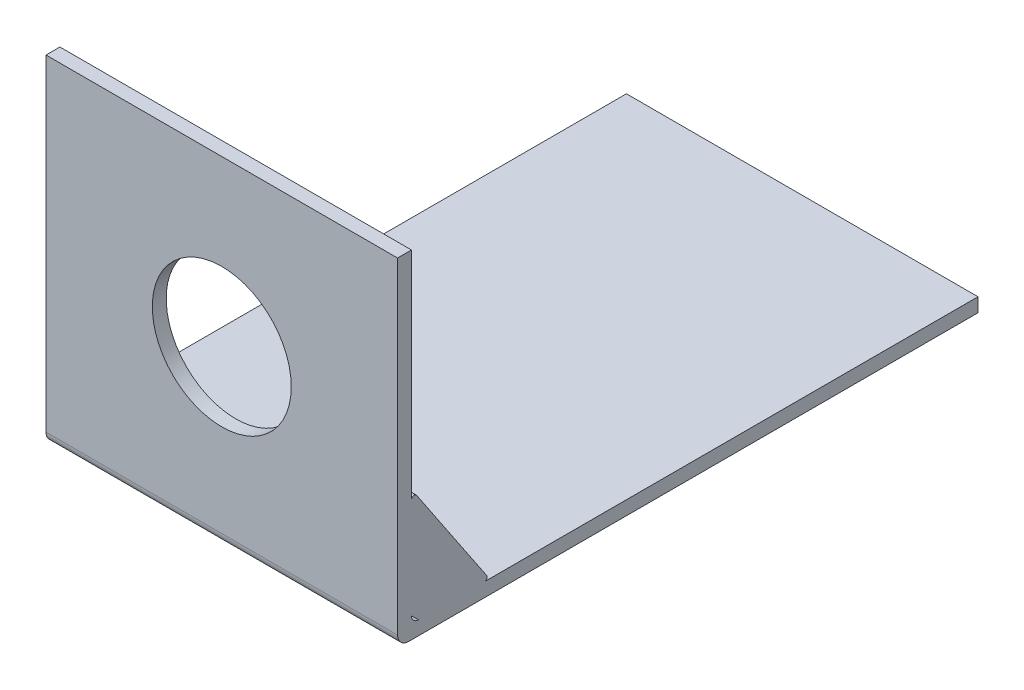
ISO-10303-21;
HEADER;
FILE_DESCRIPTION(('STEP AP214'),'2;1');
FILE_NAME('part.step','',(''),(''),'','','');
FILE_SCHEMA(('AUTOMOTIVE_DESIGN { 1 0 10303 214 1 1 1 1 }'));
ENDSEC;
DATA;
#1=APPLICATION_CONTEXT('core data for automotive mechanical design processes');
#2=APPLICATION_PROTOCOL_DEFINITION('international standard','automotive_design',2000,#1);
#3=PRODUCT_CONTEXT('',#1,'mechanical');
#4=PRODUCT('Part','Part','',(#3));
#5=PRODUCT_RELATED_PRODUCT_CATEGORY('part','',(#4));
#6=PRODUCT_DEFINITION_FORMATION('','',#4);
#7=PRODUCT_DEFINITION_CONTEXT('part definition',#1,'design');
#8=PRODUCT_DEFINITION('design','',#6,#7);
#9=PRODUCT_DEFINITION_SHAPE('','',#8);
#10=(LENGTH_UNIT() NAMED_UNIT(*) SI_UNIT(.MILLI.,.METRE.));
#11=(NAMED_UNIT(*) PLANE_ANGLE_UNIT() SI_UNIT($,.RADIAN.));
#12=(NAMED_UNIT(*) SI_UNIT($,.STERADIAN.) SOLID_ANGLE_UNIT());
#13=UNCERTAINTY_MEASURE_WITH_UNIT(LENGTH_MEASURE(1.E-05),#10,'distance_accuracy_value','');
#14=(GEOMETRIC_REPRESENTATION_CONTEXT(3) GLOBAL_UNCERTAINTY_ASSIGNED_CONTEXT((#13)) GLOBAL_UNIT_ASSIGNED_CONTEXT((#10,
#11,#12)) REPRESENTATION_CONTEXT('',''));
#15=CARTESIAN_POINT('',(0.,0.,0.));
#16=DIRECTION('',(0.,0.,1.));
#17=DIRECTION('',(1.,0.,0.));
#18=AXIS2_PLACEMENT_3D('',#15,#16,#17);
#19=CARTESIAN_POINT('',(-64.262,-59.182,-106.0958));
#20=DIRECTION('',(0.,1.,0.));
#21=DIRECTION('',(0.,0.,1.));
#22=AXIS2_PLACEMENT_3D('',#19,#20,#21);
#23=PLANE('',#22);
#24=DIRECTION('',(0.,0.,1.));
#25=VECTOR('',#24,1.);
#26=CARTESIAN_POINT('',(-64.262,-59.182,-106.0958));
#27=LINE('',#26,#25);
#28=CARTESIAN_POINT('',(-64.262,-59.182,-106.0958));
#29=VERTEX_POINT('',#28);
#30=CARTESIAN_POINT('',(-64.262,-59.182,-15.8724496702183));
#31=VERTEX_POINT('',#30);
#32=EDGE_CURVE('E310',#29,#31,#27,.T.);
#33=ORIENTED_EDGE('',*,*,#32,.T.);
#34=DIRECTION('',(-1.,0.,0.));
#35=VECTOR('',#34,1.);
#36=CARTESIAN_POINT('',(-61.722,-59.182,-15.8724496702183));
#37=LINE('',#36,#35);
#38=CARTESIAN_POINT('',(-61.722,-59.182,-15.8724496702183));
#39=VERTEX_POINT('',#38);
#40=EDGE_CURVE('E61',#39,#31,#37,.T.);
#41=ORIENTED_EDGE('',*,*,#40,.F.);
#42=DIRECTION('',(0.,0.,-1.));
#43=VECTOR('',#42,1.);
#44=CARTESIAN_POINT('',(-61.722,-59.182,-3.81000000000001));
#45=LINE('',#44,#43);
#46=CARTESIAN_POINT('',(-61.722,-59.182,-3.81000000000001));
#47=VERTEX_POINT('',#46);
#48=EDGE_CURVE('E207',#47,#39,#45,.T.);
#49=ORIENTED_EDGE('',*,*,#48,.F.);
#50=DIRECTION('',(1.,0.,0.));
#51=VECTOR('',#50,1.);
#52=CARTESIAN_POINT('',(-64.262,-59.182,-3.81000000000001));
#53=LINE('',#52,#51);
#54=CARTESIAN_POINT('',(-2.54,-59.182,-3.81000000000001));
#55=VERTEX_POINT('',#54);
#56=EDGE_CURVE('E356',#47,#55,#53,.T.);
#57=ORIENTED_EDGE('',*,*,#56,.T.);
#58=DIRECTION('',(0.,0.,-1.));
#59=VECTOR('',#58,1.);
#60=CARTESIAN_POINT('',(-2.54,-59.182,-3.81000000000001));
#61=LINE('',#60,#59);
#62=CARTESIAN_POINT('',(-2.54,-59.182,-15.8724496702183));
#63=VERTEX_POINT('',#62);
#64=EDGE_CURVE('E234',#55,#63,#61,.T.);
#65=ORIENTED_EDGE('',*,*,#64,.T.);
#66=DIRECTION('',(1.,0.,0.));
#67=VECTOR('',#66,1.);
#68=CARTESIAN_POINT('',(-2.54,-59.182,-15.8724496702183));
#69=LINE('',#68,#67);
#70=CARTESIAN_POINT('',(0.,-59.182,-15.8724496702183));
#71=VERTEX_POINT('',#70);
#72=EDGE_CURVE('E282',#63,#71,#69,.T.);
#73=ORIENTED_EDGE('',*,*,#72,.T.);
#74=DIRECTION('',(0.,0.,1.));
#75=VECTOR('',#74,1.);
#76=CARTESIAN_POINT('',(0.,-59.182,-106.0958));
#77=LINE('',#76,#75);
#78=CARTESIAN_POINT('',(0.,-59.182,-106.0958));
#79=VERTEX_POINT('',#78);
#80=EDGE_CURVE('E338',#79,#71,#77,.T.);
#81=ORIENTED_EDGE('',*,*,#80,.F.);
#82=DIRECTION('',(1.,0.,0.));
#83=VECTOR('',#82,1.);
#84=CARTESIAN_POINT('',(-64.262,-59.182,-106.0958));
#85=LINE('',#84,#83);
#86=EDGE_CURVE('E357',#29,#79,#85,.T.);
#87=ORIENTED_EDGE('',*,*,#86,.F.);
#88=EDGE_LOOP('',(#33,#41,#49,#57,#65,#73,#81,#87));
#89=FACE_BOUND('',#88,.T.);
#90=ADVANCED_FACE('F43',(#89),#23,.T.);
#91=CARTESIAN_POINT('',(-64.262,0.,0.));
#92=DIRECTION('',(0.,1.,0.));
#93=DIRECTION('',(0.,0.,1.));
#94=AXIS2_PLACEMENT_3D('',#91,#92,#93);
#95=PLANE('',#94);
#96=DIRECTION('',(0.,0.,1.));
#97=VECTOR('',#96,1.);
#98=CARTESIAN_POINT('',(0.,0.,0.));
#99=LINE('',#98,#97);
#100=CARTESIAN_POINT('',(0.,0.,-2.54));
#101=VERTEX_POINT('',#100);
#102=CARTESIAN_POINT('',(0.,0.,0.));
#103=VERTEX_POINT('',#102);
#104=EDGE_CURVE('E271',#101,#103,#99,.T.);
#105=ORIENTED_EDGE('',*,*,#104,.F.);
#106=DIRECTION('',(1.,0.,0.));
#107=VECTOR('',#106,1.);
#108=CARTESIAN_POINT('',(-64.262,0.,-2.54));
#109=LINE('',#108,#107);
#110=CARTESIAN_POINT('',(-64.262,0.,-2.54));
#111=VERTEX_POINT('',#110);
#112=EDGE_CURVE('E11',#111,#101,#109,.T.);
#113=ORIENTED_EDGE('',*,*,#112,.F.);
#114=DIRECTION('',(0.,0.,1.));
#115=VECTOR('',#114,1.);
#116=CARTESIAN_POINT('',(-64.262,0.,0.));
#117=LINE('',#116,#115);
#118=CARTESIAN_POINT('',(-64.262,0.,0.));
#119=VERTEX_POINT('',#118);
#120=EDGE_CURVE('E289',#111,#119,#117,.T.);
#121=ORIENTED_EDGE('',*,*,#120,.T.);
#122=DIRECTION('',(1.,0.,0.));
#123=VECTOR('',#122,1.);
#124=CARTESIAN_POINT('',(-64.262,0.,0.));
#125=LINE('',#124,#123);
#126=EDGE_CURVE('E47',#119,#103,#125,.T.);
#127=ORIENTED_EDGE('',*,*,#126,.T.);
#128=EDGE_LOOP('',(#105,#113,#121,#127));
#129=FACE_BOUND('',#128,.T.);
#130=ADVANCED_FACE('F45',(#129),#95,.T.);
#131=CARTESIAN_POINT('',(-64.262,0.,-2.54));
#132=DIRECTION('',(0.,0.,-1.));
#133=DIRECTION('',(0.,1.,0.));
#134=AXIS2_PLACEMENT_3D('',#131,#132,#133);
#135=PLANE('',#134);
#136=CARTESIAN_POINT('',(-32.131,-30.099,-2.54));
#137=DIRECTION('',(0.,0.,-1.));
#138=DIRECTION('',(0.,1.,0.));
#139=AXIS2_PLACEMENT_3D('',#136,#137,#138);
#140=CIRCLE('',#139,12.7);
#141=CARTESIAN_POINT('',(-32.131,-17.399,-2.54));
#142=VERTEX_POINT('',#141);
#143=EDGE_CURVE('E454',#142,#142,#140,.F.);
#144=ORIENTED_EDGE('',*,*,#143,.T.);
#145=EDGE_LOOP('',(#144));
#146=FACE_BOUND('',#145,.T.);
#147=DIRECTION('',(-1.,0.,0.));
#148=VECTOR('',#147,1.);
#149=CARTESIAN_POINT('',(-61.722,-39.5547256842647,-2.54));
#150=LINE('',#149,#148);
#151=CARTESIAN_POINT('',(-61.722,-39.5547256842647,-2.54));
#152=VERTEX_POINT('',#151);
#153=CARTESIAN_POINT('',(-64.262,-39.5547256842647,-2.54));
#154=VERTEX_POINT('',#153);
#155=EDGE_CURVE('E195',#152,#154,#150,.T.);
#156=ORIENTED_EDGE('',*,*,#155,.T.);
#157=DIRECTION('',(0.,1.,0.));
#158=VECTOR('',#157,1.);
#159=CARTESIAN_POINT('',(-64.262,0.,-2.54));
#160=LINE('',#159,#158);
#161=EDGE_CURVE('E316',#154,#111,#160,.T.);
#162=ORIENTED_EDGE('',*,*,#161,.T.);
#163=ORIENTED_EDGE('',*,*,#112,.T.);
#164=DIRECTION('',(0.,1.,0.));
#165=VECTOR('',#164,1.);
#166=CARTESIAN_POINT('',(0.,0.,-2.54));
#167=LINE('',#166,#165);
#168=CARTESIAN_POINT('',(0.,-39.5547256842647,-2.54000000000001));
#169=VERTEX_POINT('',#168);
#170=EDGE_CURVE('E294',#169,#101,#167,.T.);
#171=ORIENTED_EDGE('',*,*,#170,.F.);
#172=DIRECTION('',(1.,0.,0.));
#173=VECTOR('',#172,1.);
#174=CARTESIAN_POINT('',(-2.54,-39.5547256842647,-2.54));
#175=LINE('',#174,#173);
#176=CARTESIAN_POINT('',(-2.54,-39.5547256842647,-2.54));
#177=VERTEX_POINT('',#176);
#178=EDGE_CURVE('E272',#177,#169,#175,.T.);
#179=ORIENTED_EDGE('',*,*,#178,.F.);
#180=DIRECTION('',(0.,-1.,0.));
#181=VECTOR('',#180,1.);
#182=CARTESIAN_POINT('',(-2.54,-57.912,-2.54000000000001));
#183=LINE('',#182,#181);
#184=CARTESIAN_POINT('',(-2.54,-57.912,-2.54000000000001));
#185=VERTEX_POINT('',#184);
#186=EDGE_CURVE('E250',#177,#185,#183,.T.);
#187=ORIENTED_EDGE('',*,*,#186,.T.);
#188=DIRECTION('',(1.,0.,0.));
#189=VECTOR('',#188,1.);
#190=CARTESIAN_POINT('',(-64.262,-57.912,-2.54000000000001));
#191=LINE('',#190,#189);
#192=CARTESIAN_POINT('',(-61.722,-57.912,-2.54000000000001));
#193=VERTEX_POINT('',#192);
#194=EDGE_CURVE('E351',#193,#185,#191,.T.);
#195=ORIENTED_EDGE('',*,*,#194,.F.);
#196=DIRECTION('',(0.,-1.,0.));
#197=VECTOR('',#196,1.);
#198=CARTESIAN_POINT('',(-61.722,-57.912,-2.54000000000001));
#199=LINE('',#198,#197);
#200=EDGE_CURVE('E69',#152,#193,#199,.T.);
#201=ORIENTED_EDGE('',*,*,#200,.F.);
#202=EDGE_LOOP('',(#156,#162,#163,#171,#179,#187,#195,#201));
#203=FACE_BOUND('',#202,.T.);
#204=ADVANCED_FACE('F383',(#146,#203),#135,.T.);
#205=CARTESIAN_POINT('',(-64.262,-57.912,-3.81000000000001));
#206=DIRECTION('',(1.,0.,0.));
#207=DIRECTION('',(0.,0.,-1.));
#208=AXIS2_PLACEMENT_3D('',#205,#206,#207);
#209=CYLINDRICAL_SURFACE('',#208,1.27);
#210=CARTESIAN_POINT('',(0.,-57.912,-3.81000000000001));
#211=DIRECTION('',(-1.,0.,0.));
#212=DIRECTION('',(0.,0.,1.));
#213=AXIS2_PLACEMENT_3D('',#210,#211,#212);
#214=CIRCLE('',#213,1.27);
#215=CARTESIAN_POINT('',(0.,-59.182,-3.81000000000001));
#216=VERTEX_POINT('',#215);
#217=CARTESIAN_POINT('',(0.,-57.912,-2.54000000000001));
#218=VERTEX_POINT('',#217);
#219=EDGE_CURVE('E342',#216,#218,#214,.T.);
#220=ORIENTED_EDGE('',*,*,#219,.F.);
#221=DIRECTION('',(1.,0.,0.));
#222=VECTOR('',#221,1.);
#223=CARTESIAN_POINT('',(-2.54,-59.182,-3.81000000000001));
#224=LINE('',#223,#222);
#225=EDGE_CURVE('E254',#55,#216,#224,.T.);
#226=ORIENTED_EDGE('',*,*,#225,.F.);
#227=ORIENTED_EDGE('',*,*,#56,.F.);
#228=CARTESIAN_POINT('',(-64.262,-59.182,-3.81000000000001));
#229=VERTEX_POINT('',#228);
#230=EDGE_CURVE('E352',#229,#47,#53,.T.);
#231=ORIENTED_EDGE('',*,*,#230,.F.);
#232=CARTESIAN_POINT('',(-64.262,-57.912,-3.81000000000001));
#233=DIRECTION('',(-1.,0.,0.));
#234=DIRECTION('',(0.,0.,1.));
#235=AXIS2_PLACEMENT_3D('',#232,#233,#234);
#236=CIRCLE('',#235,1.27);
#237=CARTESIAN_POINT('',(-64.262,-57.912,-2.54000000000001));
#238=VERTEX_POINT('',#237);
#239=EDGE_CURVE('E313',#229,#238,#236,.T.);
#240=ORIENTED_EDGE('',*,*,#239,.T.);
#241=EDGE_CURVE('E53',#238,#193,#191,.T.);
#242=ORIENTED_EDGE('',*,*,#241,.T.);
#243=ORIENTED_EDGE('',*,*,#194,.T.);
#244=DIRECTION('',(1.,0.,0.));
#245=VECTOR('',#244,1.);
#246=CARTESIAN_POINT('',(-2.54,-57.912,-2.54000000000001));
#247=LINE('',#246,#245);
#248=EDGE_CURVE('E267',#185,#218,#247,.T.);
#249=ORIENTED_EDGE('',*,*,#248,.T.);
#250=EDGE_LOOP('',(#220,#226,#227,#231,#240,#242,#243,#249));
#251=FACE_BOUND('',#250,.T.);
#252=ADVANCED_FACE('F423',(#251),#209,.F.);
#253=CARTESIAN_POINT('',(-64.262,-61.722,-106.0958));
#254=DIRECTION('',(0.,0.,-1.));
#255=DIRECTION('',(0.,1.,0.));
#256=AXIS2_PLACEMENT_3D('',#253,#254,#255);
#257=PLANE('',#256);
#258=DIRECTION('',(0.,1.,0.));
#259=VECTOR('',#258,1.);
#260=CARTESIAN_POINT('',(0.,-61.722,-106.0958));
#261=LINE('',#260,#259);
#262=CARTESIAN_POINT('',(0.,-61.722,-106.0958));
#263=VERTEX_POINT('',#262);
#264=EDGE_CURVE('E334',#263,#79,#261,.T.);
#265=ORIENTED_EDGE('',*,*,#264,.F.);
#266=DIRECTION('',(1.,0.,0.));
#267=VECTOR('',#266,1.);
#268=CARTESIAN_POINT('',(-64.262,-61.722,-106.0958));
#269=LINE('',#268,#267);
#270=CARTESIAN_POINT('',(-64.262,-61.722,-106.0958));
#271=VERTEX_POINT('',#270);
#272=EDGE_CURVE('E360',#271,#263,#269,.T.);
#273=ORIENTED_EDGE('',*,*,#272,.F.);
#274=DIRECTION('',(0.,1.,0.));
#275=VECTOR('',#274,1.);
#276=CARTESIAN_POINT('',(-64.262,-61.722,-106.0958));
#277=LINE('',#276,#275);
#278=EDGE_CURVE('E306',#271,#29,#277,.T.);
#279=ORIENTED_EDGE('',*,*,#278,.T.);
#280=ORIENTED_EDGE('',*,*,#86,.T.);
#281=EDGE_LOOP('',(#265,#273,#279,#280));
#282=FACE_BOUND('',#281,.T.);
#283=ADVANCED_FACE('F398',(#282),#257,.T.);
#284=CARTESIAN_POINT('',(-64.262,-61.722,-2.032));
#285=DIRECTION('',(0.,-1.,0.));
#286=DIRECTION('',(0.,0.,-1.));
#287=AXIS2_PLACEMENT_3D('',#284,#285,#286);
#288=PLANE('',#287);
#289=DIRECTION('',(0.,0.,-1.));
#290=VECTOR('',#289,1.);
#291=CARTESIAN_POINT('',(0.,-61.722,-2.032));
#292=LINE('',#291,#290);
#293=CARTESIAN_POINT('',(0.,-61.722,-2.032));
#294=VERTEX_POINT('',#293);
#295=EDGE_CURVE('E330',#294,#263,#292,.T.);
#296=ORIENTED_EDGE('',*,*,#295,.F.);
#297=DIRECTION('',(1.,0.,0.));
#298=VECTOR('',#297,1.);
#299=CARTESIAN_POINT('',(-64.262,-61.722,-2.032));
#300=LINE('',#299,#298);
#301=CARTESIAN_POINT('',(-64.262,-61.722,-2.032));
#302=VERTEX_POINT('',#301);
#303=EDGE_CURVE('E363',#302,#294,#300,.T.);
#304=ORIENTED_EDGE('',*,*,#303,.F.);
#305=DIRECTION('',(0.,0.,-1.));
#306=VECTOR('',#305,1.);
#307=CARTESIAN_POINT('',(-64.262,-61.722,-2.032));
#308=LINE('',#307,#306);
#309=EDGE_CURVE('E302',#302,#271,#308,.T.);
#310=ORIENTED_EDGE('',*,*,#309,.T.);
#311=ORIENTED_EDGE('',*,*,#272,.T.);
#312=EDGE_LOOP('',(#296,#304,#310,#311));
#313=FACE_BOUND('',#312,.T.);
#314=ADVANCED_FACE('F396',(#313),#288,.T.);
#315=CARTESIAN_POINT('',(-64.262,-59.69,-2.032));
#316=DIRECTION('',(1.,0.,0.));
#317=DIRECTION('',(0.,0.,-1.));
#318=AXIS2_PLACEMENT_3D('',#315,#316,#317);
#319=CYLINDRICAL_SURFACE('',#318,2.032);
#320=CARTESIAN_POINT('',(0.,-59.69,-2.032));
#321=DIRECTION('',(1.,0.,0.));
#322=DIRECTION('',(0.,0.,1.));
#323=AXIS2_PLACEMENT_3D('',#320,#321,#322);
#324=CIRCLE('',#323,2.032);
#325=CARTESIAN_POINT('',(0.,-59.69,0.));
#326=VERTEX_POINT('',#325);
#327=EDGE_CURVE('E326',#326,#294,#324,.T.);
#328=ORIENTED_EDGE('',*,*,#327,.F.);
#329=DIRECTION('',(1.,0.,0.));
#330=VECTOR('',#329,1.);
#331=CARTESIAN_POINT('',(-64.262,-59.69,0.));
#332=LINE('',#331,#330);
#333=CARTESIAN_POINT('',(-64.262,-59.69,0.));
#334=VERTEX_POINT('',#333);
#335=EDGE_CURVE('E365',#334,#326,#332,.T.);
#336=ORIENTED_EDGE('',*,*,#335,.F.);
#337=CARTESIAN_POINT('',(-64.262,-59.69,-2.032));
#338=DIRECTION('',(1.,0.,0.));
#339=DIRECTION('',(0.,0.,1.));
#340=AXIS2_PLACEMENT_3D('',#337,#338,#339);
#341=CIRCLE('',#340,2.032);
#342=EDGE_CURVE('E298',#334,#302,#341,.T.);
#343=ORIENTED_EDGE('',*,*,#342,.T.);
#344=ORIENTED_EDGE('',*,*,#303,.T.);
#345=EDGE_LOOP('',(#328,#336,#343,#344));
#346=FACE_BOUND('',#345,.T.);
#347=ADVANCED_FACE('F392',(#346),#319,.T.);
#348=CARTESIAN_POINT('',(-64.262,-59.69,0.));
#349=DIRECTION('',(0.,0.,1.));
#350=DIRECTION('',(1.,0.,0.));
#351=AXIS2_PLACEMENT_3D('',#348,#349,#350);
#352=PLANE('',#351);
#353=CARTESIAN_POINT('',(-32.131,-30.099,0.));
#354=DIRECTION('',(0.,0.,1.));
#355=DIRECTION('',(1.,0.,0.));
#356=AXIS2_PLACEMENT_3D('',#353,#354,#355);
#357=CIRCLE('',#356,12.7);
#358=CARTESIAN_POINT('',(-19.431,-30.099,0.));
#359=VERTEX_POINT('',#358);
#360=EDGE_CURVE('E215',#359,#359,#357,.T.);
#361=ORIENTED_EDGE('',*,*,#360,.F.);
#362=EDGE_LOOP('',(#361));
#363=FACE_BOUND('',#362,.T.);
#364=DIRECTION('',(0.,-1.,0.));
#365=VECTOR('',#364,1.);
#366=CARTESIAN_POINT('',(0.,-59.69,0.));
#367=LINE('',#366,#365);
#368=EDGE_CURVE('E322',#103,#326,#367,.T.);
#369=ORIENTED_EDGE('',*,*,#368,.F.);
#370=ORIENTED_EDGE('',*,*,#126,.F.);
#371=DIRECTION('',(0.,-1.,0.));
#372=VECTOR('',#371,1.);
#373=CARTESIAN_POINT('',(-64.262,-59.69,0.));
#374=LINE('',#373,#372);
#375=EDGE_CURVE('E293',#119,#334,#374,.T.);
#376=ORIENTED_EDGE('',*,*,#375,.T.);
#377=ORIENTED_EDGE('',*,*,#335,.T.);
#378=EDGE_LOOP('',(#369,#370,#376,#377));
#379=FACE_BOUND('',#378,.T.);
#380=ADVANCED_FACE('F376',(#363,#379),#352,.T.);
#381=CARTESIAN_POINT('',(-64.262,-57.912,-3.81000000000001));
#382=DIRECTION('',(-1.,0.,0.));
#383=DIRECTION('',(0.,0.,1.));
#384=AXIS2_PLACEMENT_3D('',#381,#382,#383);
#385=PLANE('',#384);
#386=CARTESIAN_POINT('',(-64.262,-58.682,-15.8724496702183));
#387=DIRECTION('',(1.,0.,0.));
#388=DIRECTION('',(0.,0.,-1.));
#389=AXIS2_PLACEMENT_3D('',#386,#387,#388);
#390=CIRCLE('',#389,0.500000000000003);
#391=CARTESIAN_POINT('',(-64.262,-58.4034347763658,-16.2876621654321));
#392=VERTEX_POINT('',#391);
#393=EDGE_CURVE('E220',#31,#392,#390,.T.);
#394=ORIENTED_EDGE('',*,*,#393,.F.);
#395=ORIENTED_EDGE('',*,*,#32,.F.);
#396=ORIENTED_EDGE('',*,*,#278,.F.);
#397=ORIENTED_EDGE('',*,*,#309,.F.);
#398=ORIENTED_EDGE('',*,*,#342,.F.);
#399=ORIENTED_EDGE('',*,*,#375,.F.);
#400=ORIENTED_EDGE('',*,*,#120,.F.);
#401=ORIENTED_EDGE('',*,*,#161,.F.);
#402=CARTESIAN_POINT('',(-64.262,-39.5547256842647,-3.04));
#403=DIRECTION('',(1.,0.,0.));
#404=DIRECTION('',(0.,0.,1.));
#405=AXIS2_PLACEMENT_3D('',#402,#403,#404);
#406=CIRCLE('',#405,0.499999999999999);
#407=CARTESIAN_POINT('',(-64.262,-39.2761604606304,-3.45521249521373));
#408=VERTEX_POINT('',#407);
#409=EDGE_CURVE('E214',#408,#154,#406,.T.);
#410=ORIENTED_EDGE('',*,*,#409,.F.);
#411=DIRECTION('',(0.,0.830424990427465,0.557130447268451));
#412=VECTOR('',#411,1.);
#413=CARTESIAN_POINT('',(-64.262,-39.2761604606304,-3.45521249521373));
#414=LINE('',#413,#412);
#415=EDGE_CURVE('E189',#392,#408,#414,.T.);
#416=ORIENTED_EDGE('',*,*,#415,.F.);
#417=EDGE_LOOP('',(#394,#395,#396,#397,#398,#399,#400,#401,#410,#416));
#418=FACE_BOUND('',#417,.T.);
#419=ORIENTED_EDGE('',*,*,#239,.F.);
#420=DIRECTION('',(0.,-0.707106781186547,-0.707106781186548));
#421=VECTOR('',#420,1.);
#422=CARTESIAN_POINT('',(-64.262,-57.912,-2.54000000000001));
#423=LINE('',#422,#421);
#424=EDGE_CURVE('E210',#238,#229,#423,.T.);
#425=ORIENTED_EDGE('',*,*,#424,.F.);
#426=EDGE_LOOP('',(#419,#425));
#427=FACE_BOUND('',#426,.T.);
#428=ADVANCED_FACE('F386',(#418,#427),#385,.T.);
#429=CARTESIAN_POINT('',(0.,-57.912,-3.81000000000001));
#430=DIRECTION('',(-1.,0.,0.));
#431=DIRECTION('',(0.,0.,1.));
#432=AXIS2_PLACEMENT_3D('',#429,#430,#431);
#433=PLANE('',#432);
#434=CARTESIAN_POINT('',(0.,-39.5547256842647,-3.04));
#435=DIRECTION('',(1.,0.,0.));
#436=DIRECTION('',(0.,0.,1.));
#437=AXIS2_PLACEMENT_3D('',#434,#435,#436);
#438=CIRCLE('',#437,0.499999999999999);
#439=CARTESIAN_POINT('',(0.,-39.2761604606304,-3.45521249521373));
#440=VERTEX_POINT('',#439);
#441=EDGE_CURVE('E235',#440,#169,#438,.T.);
#442=ORIENTED_EDGE('',*,*,#441,.T.);
#443=ORIENTED_EDGE('',*,*,#170,.T.);
#444=ORIENTED_EDGE('',*,*,#104,.T.);
#445=ORIENTED_EDGE('',*,*,#368,.T.);
#446=ORIENTED_EDGE('',*,*,#327,.T.);
#447=ORIENTED_EDGE('',*,*,#295,.T.);
#448=ORIENTED_EDGE('',*,*,#264,.T.);
#449=ORIENTED_EDGE('',*,*,#80,.T.);
#450=CARTESIAN_POINT('',(0.,-58.682,-15.8724496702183));
#451=DIRECTION('',(1.,0.,0.));
#452=DIRECTION('',(0.,0.,-1.));
#453=AXIS2_PLACEMENT_3D('',#450,#451,#452);
#454=CIRCLE('',#453,0.500000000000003);
#455=CARTESIAN_POINT('',(0.,-58.4034347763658,-16.2876621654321));
#456=VERTEX_POINT('',#455);
#457=EDGE_CURVE('E257',#71,#456,#454,.T.);
#458=ORIENTED_EDGE('',*,*,#457,.T.);
#459=DIRECTION('',(0.,0.830424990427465,0.557130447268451));
#460=VECTOR('',#459,1.);
#461=CARTESIAN_POINT('',(0.,-39.2761604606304,-3.45521249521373));
#462=LINE('',#461,#460);
#463=EDGE_CURVE('E261',#456,#440,#462,.T.);
#464=ORIENTED_EDGE('',*,*,#463,.T.);
#465=EDGE_LOOP('',(#442,#443,#444,#445,#446,#447,#448,#449,#458,#464));
#466=FACE_BOUND('',#465,.T.);
#467=ORIENTED_EDGE('',*,*,#219,.T.);
#468=DIRECTION('',(0.,-0.707106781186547,-0.707106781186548));
#469=VECTOR('',#468,1.);
#470=CARTESIAN_POINT('',(0.,-57.912,-2.54000000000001));
#471=LINE('',#470,#469);
#472=EDGE_CURVE('E225',#218,#216,#471,.T.);
#473=ORIENTED_EDGE('',*,*,#472,.T.);
#474=EDGE_LOOP('',(#467,#473));
#475=FACE_BOUND('',#474,.T.);
#476=ADVANCED_FACE('F378',(#466,#475),#433,.F.);
#477=CARTESIAN_POINT('',(-2.54,-57.912,-2.54000000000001));
#478=DIRECTION('',(0.,-0.707106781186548,0.707106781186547));
#479=DIRECTION('',(0.,-0.707106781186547,-0.707106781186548));
#480=AXIS2_PLACEMENT_3D('',#477,#478,#479);
#481=PLANE('',#480);
#482=ORIENTED_EDGE('',*,*,#472,.F.);
#483=ORIENTED_EDGE('',*,*,#248,.F.);
#484=DIRECTION('',(0.,-0.707106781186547,-0.707106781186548));
#485=VECTOR('',#484,1.);
#486=CARTESIAN_POINT('',(-2.54,-57.912,-2.54000000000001));
#487=LINE('',#486,#485);
#488=EDGE_CURVE('E230',#185,#55,#487,.T.);
#489=ORIENTED_EDGE('',*,*,#488,.T.);
#490=ORIENTED_EDGE('',*,*,#225,.T.);
#491=EDGE_LOOP('',(#482,#483,#489,#490));
#492=FACE_BOUND('',#491,.T.);
#493=ADVANCED_FACE('F419',(#492),#481,.T.);
#494=CARTESIAN_POINT('',(-2.54,-39.5547256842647,-3.04));
#495=DIRECTION('',(1.,0.,0.));
#496=DIRECTION('',(0.,0.,-1.));
#497=AXIS2_PLACEMENT_3D('',#494,#495,#496);
#498=CYLINDRICAL_SURFACE('',#497,0.499999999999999);
#499=ORIENTED_EDGE('',*,*,#441,.F.);
#500=DIRECTION('',(1.,0.,0.));
#501=VECTOR('',#500,1.);
#502=CARTESIAN_POINT('',(-2.54,-39.2761604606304,-3.45521249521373));
#503=LINE('',#502,#501);
#504=CARTESIAN_POINT('',(-2.54,-39.2761604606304,-3.45521249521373));
#505=VERTEX_POINT('',#504);
#506=EDGE_CURVE('E276',#505,#440,#503,.T.);
#507=ORIENTED_EDGE('',*,*,#506,.F.);
#508=CARTESIAN_POINT('',(-2.54,-39.5547256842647,-3.04));
#509=DIRECTION('',(1.,0.,0.));
#510=DIRECTION('',(0.,0.,1.));
#511=AXIS2_PLACEMENT_3D('',#508,#509,#510);
#512=CIRCLE('',#511,0.499999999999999);
#513=EDGE_CURVE('E247',#505,#177,#512,.T.);
#514=ORIENTED_EDGE('',*,*,#513,.T.);
#515=ORIENTED_EDGE('',*,*,#178,.T.);
#516=EDGE_LOOP('',(#499,#507,#514,#515));
#517=FACE_BOUND('',#516,.T.);
#518=ADVANCED_FACE('F410',(#517),#498,.T.);
#519=CARTESIAN_POINT('',(-2.54,-39.2761604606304,-3.45521249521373));
#520=DIRECTION('',(0.,0.557130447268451,-0.830424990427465));
#521=DIRECTION('',(0.,0.830424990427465,0.557130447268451));
#522=AXIS2_PLACEMENT_3D('',#519,#520,#521);
#523=PLANE('',#522);
#524=ORIENTED_EDGE('',*,*,#463,.F.);
#525=DIRECTION('',(1.,0.,0.));
#526=VECTOR('',#525,1.);
#527=CARTESIAN_POINT('',(-2.54,-58.4034347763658,-16.2876621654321));
#528=LINE('',#527,#526);
#529=CARTESIAN_POINT('',(-2.54,-58.4034347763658,-16.2876621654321));
#530=VERTEX_POINT('',#529);
#531=EDGE_CURVE('E279',#530,#456,#528,.T.);
#532=ORIENTED_EDGE('',*,*,#531,.F.);
#533=DIRECTION('',(0.,0.830424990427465,0.557130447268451));
#534=VECTOR('',#533,1.);
#535=CARTESIAN_POINT('',(-2.54,-39.2761604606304,-3.45521249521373));
#536=LINE('',#535,#534);
#537=EDGE_CURVE('E243',#530,#505,#536,.T.);
#538=ORIENTED_EDGE('',*,*,#537,.T.);
#539=ORIENTED_EDGE('',*,*,#506,.T.);
#540=EDGE_LOOP('',(#524,#532,#538,#539));
#541=FACE_BOUND('',#540,.T.);
#542=ADVANCED_FACE('F407',(#541),#523,.T.);
#543=CARTESIAN_POINT('',(-2.54,-58.682,-15.8724496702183));
#544=DIRECTION('',(1.,0.,0.));
#545=DIRECTION('',(0.,0.,-1.));
#546=AXIS2_PLACEMENT_3D('',#543,#544,#545);
#547=CYLINDRICAL_SURFACE('',#546,0.500000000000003);
#548=ORIENTED_EDGE('',*,*,#457,.F.);
#549=ORIENTED_EDGE('',*,*,#72,.F.);
#550=CARTESIAN_POINT('',(-2.54,-58.682,-15.8724496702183));
#551=DIRECTION('',(1.,0.,0.));
#552=DIRECTION('',(0.,0.,-1.));
#553=AXIS2_PLACEMENT_3D('',#550,#551,#552);
#554=CIRCLE('',#553,0.500000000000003);
#555=EDGE_CURVE('E239',#63,#530,#554,.T.);
#556=ORIENTED_EDGE('',*,*,#555,.T.);
#557=ORIENTED_EDGE('',*,*,#531,.T.);
#558=EDGE_LOOP('',(#548,#549,#556,#557));
#559=FACE_BOUND('',#558,.T.);
#560=ADVANCED_FACE('F403',(#559),#547,.T.);
#561=CARTESIAN_POINT('',(-2.54,-58.682,-15.8724496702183));
#562=DIRECTION('',(1.,0.,0.));
#563=DIRECTION('',(0.,0.,-1.));
#564=AXIS2_PLACEMENT_3D('',#561,#562,#563);
#565=PLANE('',#564);
#566=ORIENTED_EDGE('',*,*,#488,.F.);
#567=ORIENTED_EDGE('',*,*,#186,.F.);
#568=ORIENTED_EDGE('',*,*,#513,.F.);
#569=ORIENTED_EDGE('',*,*,#537,.F.);
#570=ORIENTED_EDGE('',*,*,#555,.F.);
#571=ORIENTED_EDGE('',*,*,#64,.F.);
#572=EDGE_LOOP('',(#566,#567,#568,#569,#570,#571));
#573=FACE_BOUND('',#572,.T.);
#574=ADVANCED_FACE('F414',(#573),#565,.F.);
#575=CARTESIAN_POINT('',(-61.722,-57.912,-2.54000000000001));
#576=DIRECTION('',(0.,0.707106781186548,-0.707106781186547));
#577=DIRECTION('',(0.,0.707106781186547,0.707106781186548));
#578=AXIS2_PLACEMENT_3D('',#575,#576,#577);
#579=PLANE('',#578);
#580=ORIENTED_EDGE('',*,*,#424,.T.);
#581=ORIENTED_EDGE('',*,*,#230,.T.);
#582=DIRECTION('',(0.,-0.707106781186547,-0.707106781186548));
#583=VECTOR('',#582,1.);
#584=CARTESIAN_POINT('',(-61.722,-57.912,-2.54000000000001));
#585=LINE('',#584,#583);
#586=EDGE_CURVE('E201',#193,#47,#585,.T.);
#587=ORIENTED_EDGE('',*,*,#586,.F.);
#588=ORIENTED_EDGE('',*,*,#241,.F.);
#589=EDGE_LOOP('',(#580,#581,#587,#588));
#590=FACE_BOUND('',#589,.T.);
#591=ADVANCED_FACE('F463',(#590),#579,.F.);
#592=CARTESIAN_POINT('',(-61.722,-58.682,-15.8724496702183));
#593=DIRECTION('',(-1.,0.,0.));
#594=DIRECTION('',(0.,0.,1.));
#595=AXIS2_PLACEMENT_3D('',#592,#593,#594);
#596=CYLINDRICAL_SURFACE('',#595,0.500000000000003);
#597=ORIENTED_EDGE('',*,*,#393,.T.);
#598=DIRECTION('',(-1.,0.,0.));
#599=VECTOR('',#598,1.);
#600=CARTESIAN_POINT('',(-61.722,-58.4034347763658,-16.2876621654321));
#601=LINE('',#600,#599);
#602=CARTESIAN_POINT('',(-61.722,-58.4034347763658,-16.2876621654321));
#603=VERTEX_POINT('',#602);
#604=EDGE_CURVE('E194',#603,#392,#601,.T.);
#605=ORIENTED_EDGE('',*,*,#604,.F.);
#606=CARTESIAN_POINT('',(-61.722,-58.682,-15.8724496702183));
#607=DIRECTION('',(1.,0.,0.));
#608=DIRECTION('',(0.,0.,-1.));
#609=AXIS2_PLACEMENT_3D('',#606,#607,#608);
#610=CIRCLE('',#609,0.500000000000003);
#611=EDGE_CURVE('E179',#39,#603,#610,.T.);
#612=ORIENTED_EDGE('',*,*,#611,.F.);
#613=ORIENTED_EDGE('',*,*,#40,.T.);
#614=EDGE_LOOP('',(#597,#605,#612,#613));
#615=FACE_BOUND('',#614,.T.);
#616=ADVANCED_FACE('F468',(#615),#596,.T.);
#617=CARTESIAN_POINT('',(-61.722,-39.2761604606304,-3.45521249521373));
#618=DIRECTION('',(0.,-0.557130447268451,0.830424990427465));
#619=DIRECTION('',(0.,-0.830424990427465,-0.557130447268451));
#620=AXIS2_PLACEMENT_3D('',#617,#618,#619);
#621=PLANE('',#620);
#622=ORIENTED_EDGE('',*,*,#415,.T.);
#623=DIRECTION('',(-1.,0.,0.));
#624=VECTOR('',#623,1.);
#625=CARTESIAN_POINT('',(-61.722,-39.2761604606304,-3.45521249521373));
#626=LINE('',#625,#624);
#627=CARTESIAN_POINT('',(-61.722,-39.2761604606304,-3.45521249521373));
#628=VERTEX_POINT('',#627);
#629=EDGE_CURVE('E186',#628,#408,#626,.T.);
#630=ORIENTED_EDGE('',*,*,#629,.F.);
#631=DIRECTION('',(0.,0.830424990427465,0.557130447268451));
#632=VECTOR('',#631,1.);
#633=CARTESIAN_POINT('',(-61.722,-39.2761604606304,-3.45521249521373));
#634=LINE('',#633,#632);
#635=EDGE_CURVE('E171',#603,#628,#634,.T.);
#636=ORIENTED_EDGE('',*,*,#635,.F.);
#637=ORIENTED_EDGE('',*,*,#604,.T.);
#638=EDGE_LOOP('',(#622,#630,#636,#637));
#639=FACE_BOUND('',#638,.T.);
#640=ADVANCED_FACE('F187',(#639),#621,.F.);
#641=CARTESIAN_POINT('',(-61.722,-39.5547256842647,-3.04));
#642=DIRECTION('',(-1.,0.,0.));
#643=DIRECTION('',(0.,0.,1.));
#644=AXIS2_PLACEMENT_3D('',#641,#642,#643);
#645=CYLINDRICAL_SURFACE('',#644,0.499999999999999);
#646=ORIENTED_EDGE('',*,*,#409,.T.);
#647=ORIENTED_EDGE('',*,*,#155,.F.);
#648=CARTESIAN_POINT('',(-61.722,-39.5547256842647,-3.04));
#649=DIRECTION('',(1.,0.,0.));
#650=DIRECTION('',(0.,0.,1.));
#651=AXIS2_PLACEMENT_3D('',#648,#649,#650);
#652=CIRCLE('',#651,0.499999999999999);
#653=EDGE_CURVE('E176',#628,#152,#652,.T.);
#654=ORIENTED_EDGE('',*,*,#653,.F.);
#655=ORIENTED_EDGE('',*,*,#629,.T.);
#656=EDGE_LOOP('',(#646,#647,#654,#655));
#657=FACE_BOUND('',#656,.T.);
#658=ADVANCED_FACE('F197',(#657),#645,.T.);
#659=CARTESIAN_POINT('',(-61.722,-58.682,-15.8724496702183));
#660=DIRECTION('',(-1.,0.,0.));
#661=DIRECTION('',(0.,0.,-1.));
#662=AXIS2_PLACEMENT_3D('',#659,#660,#661);
#663=PLANE('',#662);
#664=ORIENTED_EDGE('',*,*,#586,.T.);
#665=ORIENTED_EDGE('',*,*,#48,.T.);
#666=ORIENTED_EDGE('',*,*,#611,.T.);
#667=ORIENTED_EDGE('',*,*,#635,.T.);
#668=ORIENTED_EDGE('',*,*,#653,.T.);
#669=ORIENTED_EDGE('',*,*,#200,.T.);
#670=EDGE_LOOP('',(#664,#665,#666,#667,#668,#669));
#671=FACE_BOUND('',#670,.T.);
#672=ADVANCED_FACE('F174',(#671),#663,.F.);
#673=CARTESIAN_POINT('',(-32.131,-30.099,-106.0968));
#674=DIRECTION('',(0.,0.,1.));
#675=DIRECTION('',(1.,0.,0.));
#676=AXIS2_PLACEMENT_3D('',#673,#674,#675);
#677=CYLINDRICAL_SURFACE('',#676,12.7);
#678=ORIENTED_EDGE('',*,*,#143,.F.);
#679=EDGE_LOOP('',(#678));
#680=FACE_BOUND('',#679,.T.);
#681=ORIENTED_EDGE('',*,*,#360,.T.);
#682=EDGE_LOOP('',(#681));
#683=FACE_BOUND('',#682,.T.);
#684=ADVANCED_FACE('F554',(#680,#683),#677,.F.);
#685=CLOSED_SHELL('',(#90,#130,#204,#252,#283,#314,#347,#380,#428,#476,#493,#518,#542,#560,#574,
#591,#616,#640,#658,#672,#684));
#686=MANIFOLD_SOLID_BREP('B2',#685);
#687=ADVANCED_BREP_SHAPE_REPRESENTATION('',(#18,#686),#14);
#688=SHAPE_DEFINITION_REPRESENTATION(#9,#687);
ENDSEC;
END-ISO-10303-21;
